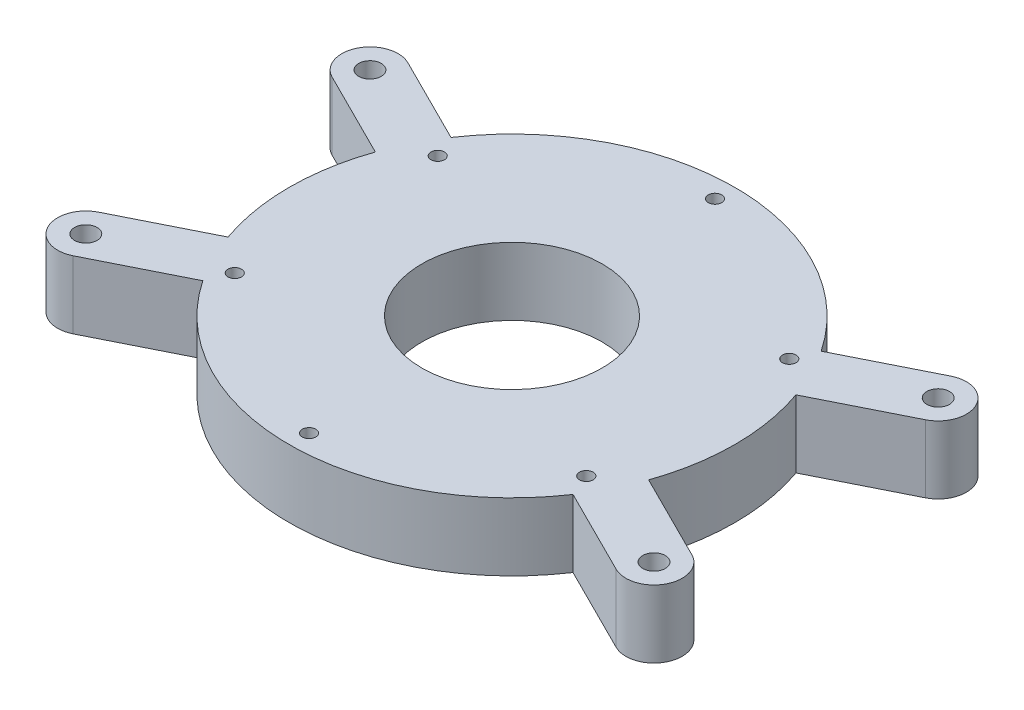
from build123d import *

# Parameters (mm, degrees)
SKETCH_1_R               = 20
EXTRUDE_1_DEPTH          = 15
SKETCH_2_R               = 2.5
CUT_EXTRUDE_1_DEPTH      = 10
MIRROR_2_COPY_1_SKETCH_R = 2.5
MIRROR_2_COPY_1_DEPTH    = 10
SKETCH_3_R               = 2.5
CUT_EXTRUDE_2_DEPTH      = 10
MIRROR_4_COPY_1_SKETCH_R = 2.5
MIRROR_4_COPY_1_DEPTH    = 10
SKETCH_4_R               = 1.5
CUT_EXTRUDE_3_DEPTH      = 87.365727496
PATTERN_CIRCULAR_1_COUNT = 6


with BuildPart() as part:
    # Sketch 1 → Extrude 1 (new body)
    with BuildSketch(Plane(origin=(0, 0, 0), x_dir=(1, 0, 0), z_dir=(0, 1, 0))):
        with BuildLine():
            Line((46.623322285, 16.328680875), (65.781966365, 25.910071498))
            ThreePointArc((65.781966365, 25.910071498), (68.576327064, 34.295567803), (60.190830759, 37.089928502))
            Line((60.190830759, 37.089928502), (41.03218668, 27.50853788))
            ThreePointArc((41.03218668, 27.50853788), (0, 49.4), (-41.03218668, 27.50853788))
            Line((-41.03218668, 27.50853788), (-60.190830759, 37.089928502))
            ThreePointArc((-60.190830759, 37.089928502), (-68.576327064, 34.295567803), (-65.781966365, 25.910071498))
            Line((-65.781966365, 25.910071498), (-46.623322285, 16.328680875))
            ThreePointArc((-46.623322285, 16.328680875), (-49.4, 0), (-46.623322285, -16.328680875))
            Line((-46.623322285, -16.328680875), (-65.781966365, -25.910071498))
            ThreePointArc((-65.781966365, -25.910071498), (-68.576327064, -34.295567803), (-60.190830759, -37.089928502))
            Line((-60.190830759, -37.089928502), (-41.03218668, -27.50853788))
            ThreePointArc((-41.03218668, -27.50853788), (0, -49.4), (41.03218668, -27.50853788))
            Line((41.03218668, -27.50853788), (60.190830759, -37.089928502))
            ThreePointArc((60.190830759, -37.089928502), (68.576327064, -34.295567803), (65.781966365, -25.910071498))
            Line((65.781966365, -25.910071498), (46.623322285, -16.328680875))
            ThreePointArc((46.623322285, -16.328680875), (49.4, 0), (46.623322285, 16.328680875))
        make_face()
        with Locations(Location((0, 0, 0), (0, 0, 270))):
            Circle(SKETCH_1_R, mode=Mode.SUBTRACT)
    extrude(amount=EXTRUDE_1_DEPTH)

    # Sketch 2 → Cut-Extrude 1 (cut)
    with BuildSketch(Plane(origin=(0, 15, 0), x_dir=(1, 0, 0), z_dir=(0, 1, 0))):
        with Locations(Location((-62.986398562, 31.5, 0), (0, 0, 270))):
            Circle(SKETCH_2_R)
    cut_extrude_1 = extrude(amount=-CUT_EXTRUDE_1_DEPTH, mode=Mode.SUBTRACT)

    # Mirror 1: Cut-Extrude 1 across plane
    add(cut_extrude_1.mirror(Plane.XY), mode=Mode.SUBTRACT)

    # Mirror 2: Cut-Extrude 1 across plane
    add(cut_extrude_1.mirror(Plane(origin=(0, 0, 0), x_dir=(0, 0, 1), z_dir=(1, 0, 0))), mode=Mode.SUBTRACT)

    # Mirror 2 copy 1 sketch → Mirror 2 copy 1 (cut)
    with BuildSketch(Plane(origin=(0, 15, 0), x_dir=(-1, 0, 0), z_dir=(0, 1, 0))):
        with Locations(Location((-62.986398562, 31.5, 0), (0, 0, 270))):
            Circle(MIRROR_2_COPY_1_SKETCH_R)
    extrude(amount=-MIRROR_2_COPY_1_DEPTH, mode=Mode.SUBTRACT)

    # Sketch 3 → Cut-Extrude 2 (cut)
    with BuildSketch(Plane.XZ):
        with Locations(Location((-54.042512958, 27.027091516, 0), (0, 0, 270))):
            Circle(SKETCH_3_R)
    cut_extrude_2 = extrude(amount=-CUT_EXTRUDE_2_DEPTH, mode=Mode.SUBTRACT)

    # Mirror 3: Cut-Extrude 2 across plane
    add(cut_extrude_2.mirror(Plane(origin=(0, 0, 0), x_dir=(0, 0, 1), z_dir=(1, 0, 0))), mode=Mode.SUBTRACT)

    # Mirror 4: Cut-Extrude 2 across plane
    add(cut_extrude_2.mirror(Plane.XY), mode=Mode.SUBTRACT)

    # Mirror 4 copy 1 sketch → Mirror 4 copy 1 (cut)
    with BuildSketch(Plane(origin=(0, 0, 0), x_dir=(-1, 0, 0), z_dir=(0, -1, 0))):
        with Locations(Location((-54.042512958, 27.027091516, 0), (0, 0, 270))):
            Circle(MIRROR_4_COPY_1_SKETCH_R)
    extrude(amount=-MIRROR_4_COPY_1_DEPTH, mode=Mode.SUBTRACT)

    # Sketch 4 → Cut-Extrude 3 (cut, through all)
    with BuildSketch(Plane.XZ):
        with Locations(Location((0, -45, 0), (0, 0, 270))):
            Circle(SKETCH_4_R)
    cut_extrude_3 = extrude(amount=-CUT_EXTRUDE_3_DEPTH, mode=Mode.SUBTRACT)

    # Pattern Circular 1: Cut-Extrude 3 ×6 about axis
    pattern_circular_1_axis = Axis((0, 0, 0), (0, 1, 0))
    for i in range(1, PATTERN_CIRCULAR_1_COUNT):
        add(cut_extrude_3.rotate(pattern_circular_1_axis, i * 360 / PATTERN_CIRCULAR_1_COUNT), mode=Mode.SUBTRACT)


solid = part.part
